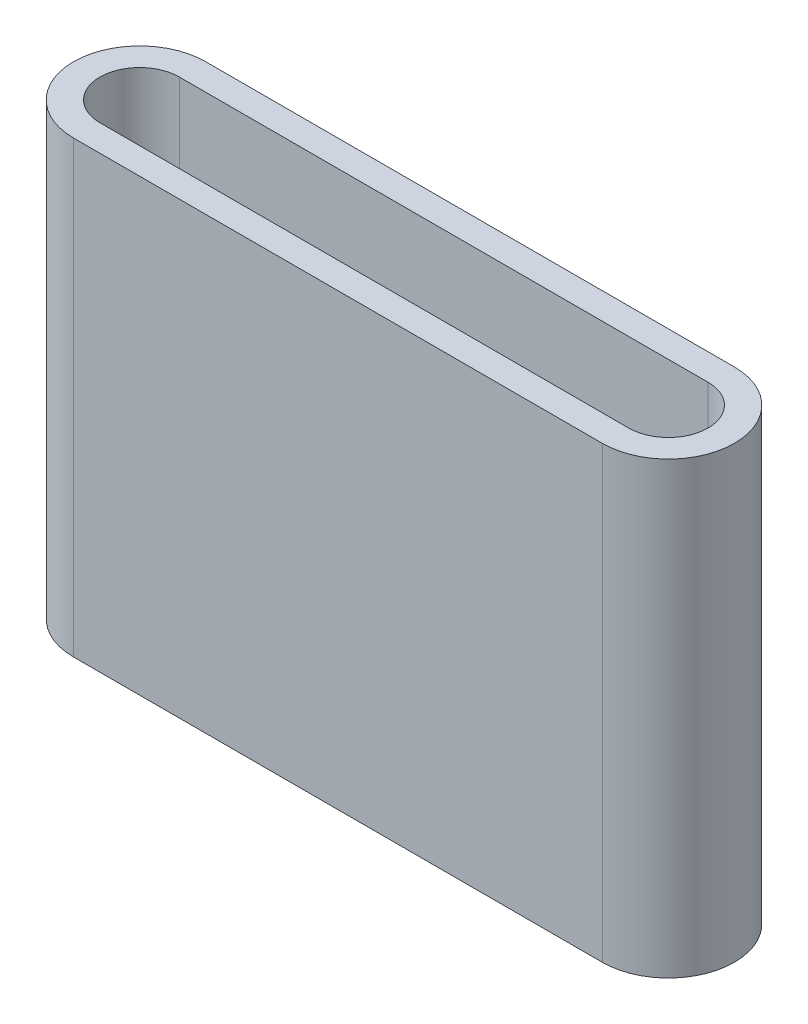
from build123d import *

# Parameters (mm, degrees)
EXTRUDE_1_DEPTH      = 20
EXTRUDE_1_DEPTH_BACK = 10
EXTRUDE_1_2_DEPTH    = 55


with BuildPart() as part:
    # Sketch 1 → Extrude 1 (new, two sides: drawn at the far end of the back side and taken through both)
    with BuildSketch(Plane(origin=(0, 0, 0), x_dir=(1, 0, 0), z_dir=(0, 1, 0)).offset(-EXTRUDE_1_DEPTH_BACK)):
        with BuildLine():
            Line((0, 12.5), (100, 12.5))
            ThreePointArc((100, 12.5), (112.5, 0), (100, -12.5))
            Line((100, -12.5), (0, -12.5))
            ThreePointArc((0, -12.5), (-12.5, 0), (0, 12.5))
        make_face()
    extrude(amount=EXTRUDE_1_DEPTH + EXTRUDE_1_DEPTH_BACK)

    # Sketch 2 → Extrude 1 2 (add)
    with BuildSketch(Plane(origin=(0, 20, 0), x_dir=(1, 0, 0), z_dir=(0, 1, 0))):
        with BuildLine():
            Line((100, 12.5), (0, 12.5))
            ThreePointArc((0, 12.5), (-12.5, 0), (0, -12.5))
            Line((0, -12.5), (100, -12.5))
            ThreePointArc((100, -12.5), (112.5, 0), (100, 12.5))
        make_face()
        with BuildLine():
            Line((100, 7.5), (0, 7.5))
            ThreePointArc((0, 7.5), (-7.5, 0), (0, -7.5))
            Line((0, -7.5), (100, -7.5))
            ThreePointArc((100, -7.5), (107.5, 0), (100, 7.5))
        make_face(mode=Mode.SUBTRACT)
    extrude(amount=EXTRUDE_1_2_DEPTH)


solid = part.part
